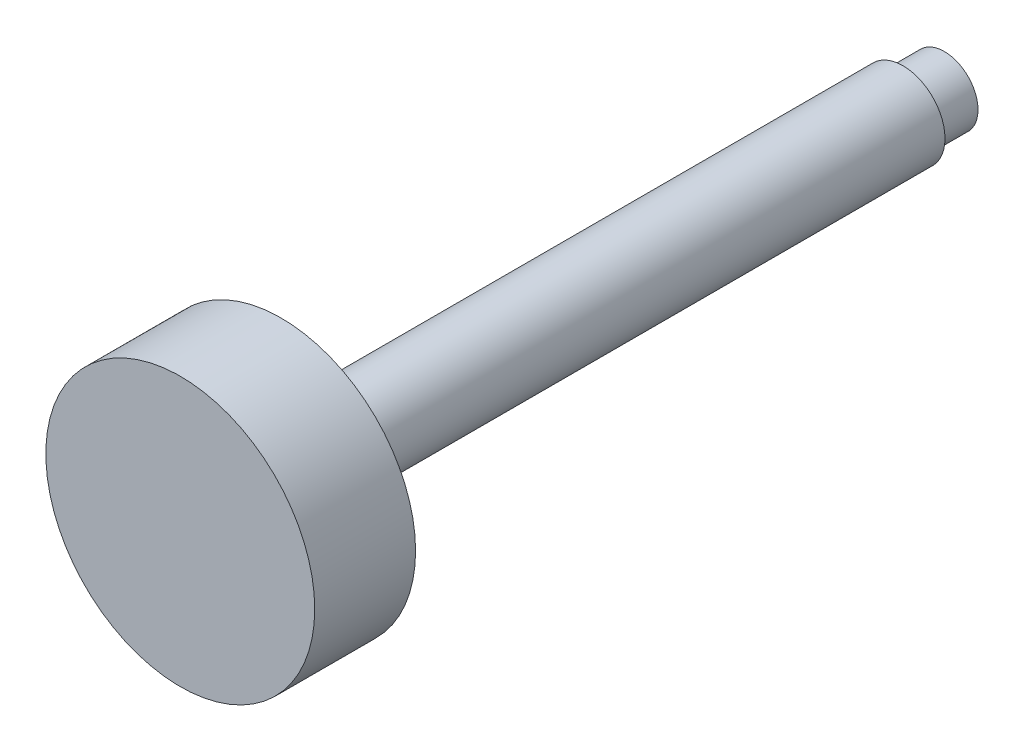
ISO-10303-21;
HEADER;
FILE_DESCRIPTION(('STEP AP214'),'2;1');
FILE_NAME('part.step','',(''),(''),'','','');
FILE_SCHEMA(('AUTOMOTIVE_DESIGN { 1 0 10303 214 1 1 1 1 }'));
ENDSEC;
DATA;
#1=APPLICATION_CONTEXT('core data for automotive mechanical design processes');
#2=APPLICATION_PROTOCOL_DEFINITION('international standard','automotive_design',2000,#1);
#3=PRODUCT_CONTEXT('',#1,'mechanical');
#4=PRODUCT('Part','Part','',(#3));
#5=PRODUCT_RELATED_PRODUCT_CATEGORY('part','',(#4));
#6=PRODUCT_DEFINITION_FORMATION('','',#4);
#7=PRODUCT_DEFINITION_CONTEXT('part definition',#1,'design');
#8=PRODUCT_DEFINITION('design','',#6,#7);
#9=PRODUCT_DEFINITION_SHAPE('','',#8);
#10=(LENGTH_UNIT() NAMED_UNIT(*) SI_UNIT(.MILLI.,.METRE.));
#11=(NAMED_UNIT(*) PLANE_ANGLE_UNIT() SI_UNIT($,.RADIAN.));
#12=(NAMED_UNIT(*) SI_UNIT($,.STERADIAN.) SOLID_ANGLE_UNIT());
#13=UNCERTAINTY_MEASURE_WITH_UNIT(LENGTH_MEASURE(1.E-05),#10,'distance_accuracy_value','');
#14=(GEOMETRIC_REPRESENTATION_CONTEXT(3) GLOBAL_UNCERTAINTY_ASSIGNED_CONTEXT((#13)) GLOBAL_UNIT_ASSIGNED_CONTEXT((#10,
#11,#12)) REPRESENTATION_CONTEXT('',''));
#15=CARTESIAN_POINT('',(0.,0.,0.));
#16=DIRECTION('',(0.,0.,1.));
#17=DIRECTION('',(1.,0.,0.));
#18=AXIS2_PLACEMENT_3D('',#15,#16,#17);
#19=CARTESIAN_POINT('',(0.,0.,4.));
#20=DIRECTION('',(0.,0.,1.));
#21=DIRECTION('',(1.,0.,0.));
#22=AXIS2_PLACEMENT_3D('',#19,#20,#21);
#23=SPHERICAL_SURFACE('',#22,4.);
#24=CARTESIAN_POINT('',(0.,0.,0.535898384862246));
#25=DIRECTION('',(0.,0.,1.));
#26=DIRECTION('',(1.,0.,0.));
#27=AXIS2_PLACEMENT_3D('',#24,#25,#26);
#28=CIRCLE('',#27,2.);
#29=CARTESIAN_POINT('',(2.,0.,0.535898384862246));
#30=VERTEX_POINT('',#29);
#31=EDGE_CURVE('E8',#30,#30,#28,.T.);
#32=ORIENTED_EDGE('',*,*,#31,.F.);
#33=EDGE_LOOP('',(#32));
#34=FACE_BOUND('',#33,.T.);
#35=ADVANCED_FACE('F12',(#34),#23,.T.);
#36=CARTESIAN_POINT('',(0.,0.,40.017563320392));
#37=DIRECTION('',(0.,0.,1.));
#38=DIRECTION('',(1.,0.,0.));
#39=AXIS2_PLACEMENT_3D('',#36,#37,#38);
#40=CYLINDRICAL_SURFACE('',#39,2.);
#41=CARTESIAN_POINT('',(0.,0.,3.));
#42=DIRECTION('',(0.,0.,1.));
#43=DIRECTION('',(1.,0.,0.));
#44=AXIS2_PLACEMENT_3D('',#41,#42,#43);
#45=CIRCLE('',#44,2.);
#46=CARTESIAN_POINT('',(2.,0.,3.));
#47=VERTEX_POINT('',#46);
#48=EDGE_CURVE('E18',#47,#47,#45,.T.);
#49=ORIENTED_EDGE('',*,*,#48,.F.);
#50=EDGE_LOOP('',(#49));
#51=FACE_BOUND('',#50,.T.);
#52=ORIENTED_EDGE('',*,*,#31,.T.);
#53=EDGE_LOOP('',(#52));
#54=FACE_BOUND('',#53,.T.);
#55=ADVANCED_FACE('F60',(#51,#54),#40,.T.);
#56=CARTESIAN_POINT('',(-2.,0.,3.));
#57=DIRECTION('',(0.,0.,1.));
#58=DIRECTION('',(1.,0.,0.));
#59=AXIS2_PLACEMENT_3D('',#56,#57,#58);
#60=PLANE('',#59);
#61=CARTESIAN_POINT('',(0.,0.,3.));
#62=DIRECTION('',(0.,0.,1.));
#63=DIRECTION('',(1.,0.,0.));
#64=AXIS2_PLACEMENT_3D('',#61,#62,#63);
#65=CIRCLE('',#64,2.5);
#66=CARTESIAN_POINT('',(2.5,0.,3.));
#67=VERTEX_POINT('',#66);
#68=EDGE_CURVE('E22',#67,#67,#65,.T.);
#69=ORIENTED_EDGE('',*,*,#68,.F.);
#70=EDGE_LOOP('',(#69));
#71=FACE_BOUND('',#70,.T.);
#72=ORIENTED_EDGE('',*,*,#48,.T.);
#73=EDGE_LOOP('',(#72));
#74=FACE_BOUND('',#73,.T.);
#75=ADVANCED_FACE('F55',(#71,#74),#60,.F.);
#76=CARTESIAN_POINT('',(0.,0.,40.017563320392));
#77=DIRECTION('',(0.,0.,1.));
#78=DIRECTION('',(1.,0.,0.));
#79=AXIS2_PLACEMENT_3D('',#76,#77,#78);
#80=CYLINDRICAL_SURFACE('',#79,2.5);
#81=CARTESIAN_POINT('',(0.,0.,40.));
#82=DIRECTION('',(0.,0.,1.));
#83=DIRECTION('',(1.,0.,0.));
#84=AXIS2_PLACEMENT_3D('',#81,#82,#83);
#85=CIRCLE('',#84,2.5);
#86=CARTESIAN_POINT('',(2.5,0.,40.));
#87=VERTEX_POINT('',#86);
#88=EDGE_CURVE('E26',#87,#87,#85,.T.);
#89=ORIENTED_EDGE('',*,*,#88,.F.);
#90=EDGE_LOOP('',(#89));
#91=FACE_BOUND('',#90,.T.);
#92=ORIENTED_EDGE('',*,*,#68,.T.);
#93=EDGE_LOOP('',(#92));
#94=FACE_BOUND('',#93,.T.);
#95=ADVANCED_FACE('F49',(#91,#94),#80,.T.);
#96=CARTESIAN_POINT('',(-2.5,0.,40.));
#97=DIRECTION('',(0.,0.,1.));
#98=DIRECTION('',(1.,0.,0.));
#99=AXIS2_PLACEMENT_3D('',#96,#97,#98);
#100=PLANE('',#99);
#101=CARTESIAN_POINT('',(0.,0.,40.));
#102=DIRECTION('',(0.,0.,1.));
#103=DIRECTION('',(1.,0.,0.));
#104=AXIS2_PLACEMENT_3D('',#101,#102,#103);
#105=CIRCLE('',#104,8.);
#106=CARTESIAN_POINT('',(8.,0.,40.));
#107=VERTEX_POINT('',#106);
#108=EDGE_CURVE('E31',#107,#107,#105,.T.);
#109=ORIENTED_EDGE('',*,*,#108,.F.);
#110=EDGE_LOOP('',(#109));
#111=FACE_BOUND('',#110,.T.);
#112=ORIENTED_EDGE('',*,*,#88,.T.);
#113=EDGE_LOOP('',(#112));
#114=FACE_BOUND('',#113,.T.);
#115=ADVANCED_FACE('F43',(#111,#114),#100,.F.);
#116=CARTESIAN_POINT('',(0.,0.,40.017563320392));
#117=DIRECTION('',(0.,0.,1.));
#118=DIRECTION('',(1.,0.,0.));
#119=AXIS2_PLACEMENT_3D('',#116,#117,#118);
#120=CYLINDRICAL_SURFACE('',#119,8.);
#121=CARTESIAN_POINT('',(0.,0.,46.));
#122=DIRECTION('',(0.,0.,1.));
#123=DIRECTION('',(1.,0.,0.));
#124=AXIS2_PLACEMENT_3D('',#121,#122,#123);
#125=CIRCLE('',#124,8.);
#126=CARTESIAN_POINT('',(8.,0.,46.));
#127=VERTEX_POINT('',#126);
#128=EDGE_CURVE('E34',#127,#127,#125,.T.);
#129=ORIENTED_EDGE('',*,*,#128,.F.);
#130=EDGE_LOOP('',(#129));
#131=FACE_BOUND('',#130,.T.);
#132=ORIENTED_EDGE('',*,*,#108,.T.);
#133=EDGE_LOOP('',(#132));
#134=FACE_BOUND('',#133,.T.);
#135=ADVANCED_FACE('F40',(#131,#134),#120,.T.);
#136=CARTESIAN_POINT('',(-8.,0.,46.));
#137=DIRECTION('',(0.,0.,-1.));
#138=DIRECTION('',(-1.,0.,0.));
#139=AXIS2_PLACEMENT_3D('',#136,#137,#138);
#140=PLANE('',#139);
#141=ORIENTED_EDGE('',*,*,#128,.T.);
#142=EDGE_LOOP('',(#141));
#143=FACE_BOUND('',#142,.T.);
#144=ADVANCED_FACE('F38',(#143),#140,.F.);
#145=CLOSED_SHELL('',(#35,#55,#75,#95,#115,#135,#144));
#146=MANIFOLD_SOLID_BREP('B1',#145);
#147=ADVANCED_BREP_SHAPE_REPRESENTATION('',(#18,#146),#14);
#148=SHAPE_DEFINITION_REPRESENTATION(#9,#147);
ENDSEC;
END-ISO-10303-21;
